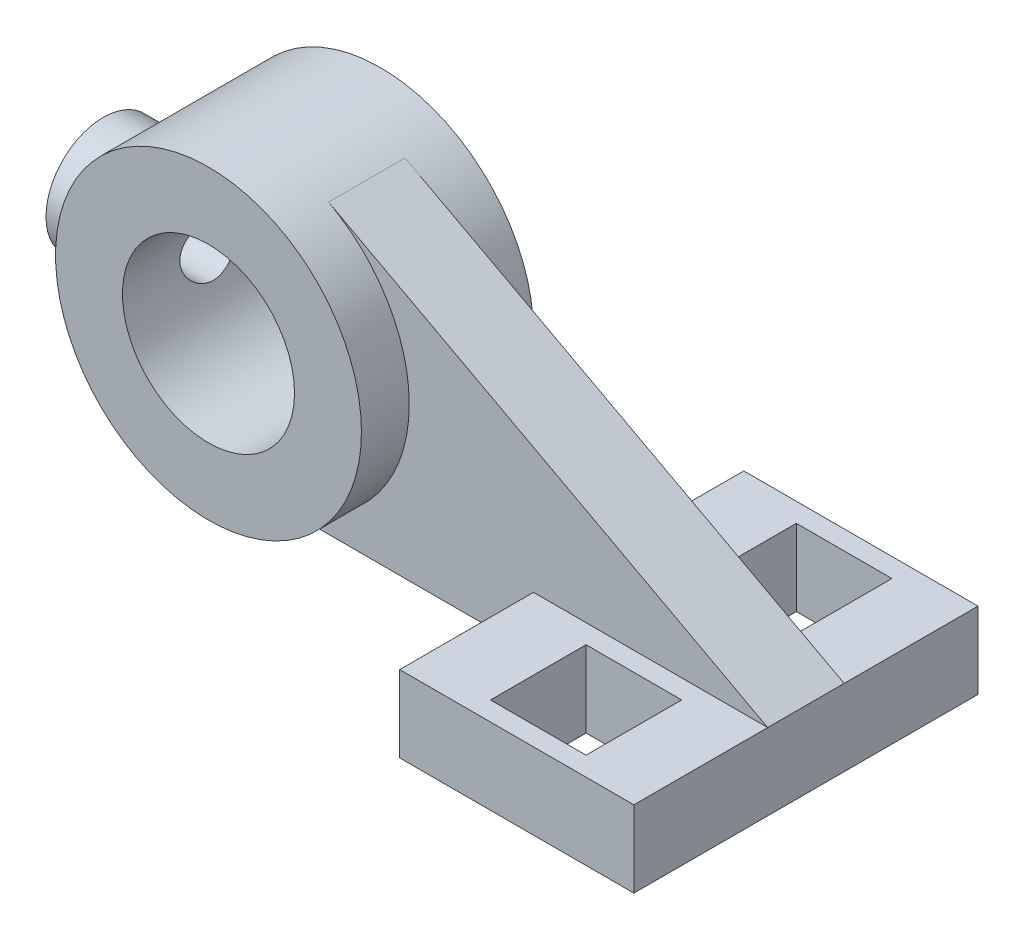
from build123d import *

# Parameters (mm, degrees)
EXTRUDE_1_DEPTH          = 36
EXTRUDE_1_DEPTH_BACK     = 36
SKETCH_1_R               = 64
SKETCH_1_R_2             = 36
EXTRUDE_2_DEPTH          = 16
EXTRUDE_2_DEPTH_BACK     = 16
EXTRUDE_3_DEPTH          = 72
EXTRUDE_3_DEPTH_BACK     = 72
SKETCH_1_4_W             = 98
SKETCH_1_4_H             = 32
SKETCH_2_W               = 40
SKETCH_2_H               = 40
CUT_EXTRUDE_1_DEPTH      = 250.491469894
EXTRUDE_4_REACH          = 313.636
EXTRUDE_4_END_RADIUS     = 64
SKETCH_3_R               = 24
CUT_EXTRUDE_2_REACH      = 313.636
CUT_EXTRUDE_2_END_RADIUS = 36
SKETCH_4_R               = 12


with BuildPart() as part:
    # Sketch 1 → Extrude 1 (new, two sides: drawn at the far end of the back side and taken through both)
    with BuildSketch(Plane.XY.offset(-EXTRUDE_1_DEPTH_BACK)):
        Circle(SKETCH_1_R)
        Circle(SKETCH_1_R_2, mode=Mode.SUBTRACT)
    extrude(amount=EXTRUDE_1_DEPTH + EXTRUDE_1_DEPTH_BACK)

    # Sketch 1_3 → Extrude 2 (add, two sides: drawn at the far end of the back side and taken through both)
    with BuildSketch(Plane.XY.offset(-EXTRUDE_2_DEPTH_BACK)):
        with BuildLine():
            Line((214, -42.141384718), (30.24689643, 56.40146502))
            ThreePointArc((30.24689643, 56.40146502), (54.917216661, 32.864864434), (64, 0))
            ThreePointArc((64, 0), (45.254833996, -45.254833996), (0, -64))
            Line((0, -64), (116, -64))
            Line((116, -64), (116, -42.141384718))
            Line((116, -42.141384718), (214, -42.141384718))
        make_face()
    extrude(amount=EXTRUDE_2_DEPTH + EXTRUDE_2_DEPTH_BACK)

    # Sketch 1_4 → Extrude 3 (add, two sides: drawn at the far end of the back side and taken through both)
    with BuildSketch(Plane.XY.offset(-EXTRUDE_3_DEPTH_BACK)):
        with Locations((165, -58.141384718)):
            Rectangle(SKETCH_1_4_W, SKETCH_1_4_H)
    extrude(amount=EXTRUDE_3_DEPTH + EXTRUDE_3_DEPTH_BACK)

    # Sketch 2 → Cut-Extrude 1 (cut, through all)
    with BuildSketch(Plane(origin=(0, -42.141384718, 0), x_dir=(1, 0, 0), z_dir=(0, 1, 0))):
        with Locations((166, -44)):
            Rectangle(SKETCH_2_W, SKETCH_2_H)
    cut_extrude_1 = extrude(amount=-CUT_EXTRUDE_1_DEPTH, mode=Mode.SUBTRACT)

    # Mirror 1: Cut-Extrude 1 across plane
    add(cut_extrude_1.mirror(Plane.XY), mode=Mode.SUBTRACT)

    # Extrude 4: up to this cylinder (the profile starts outside it)
    extrude_4_end = Plane(origin=(0, 0, 0), z_dir=(0, 0, 1)) * Cylinder(EXTRUDE_4_END_RADIUS, 756.272, mode=Mode.PRIVATE)
    # Sketch 3 → Extrude 4 (add, up to the surface)
    with BuildSketch(Plane(origin=(-80, 0, 0), x_dir=(0, 0, -1), z_dir=(1, 0, 0)), mode=Mode.PRIVATE) as extrude_4_sk1:
        with Locations(Location((0, 0, 0), (0, 0, 180))):
            Circle(SKETCH_3_R)
    extrude_4_tool1 = extrude(extrude_4_sk1.sketch, amount=EXTRUDE_4_REACH, mode=Mode.PRIVATE) - extrude_4_end
    add(extrude_4_tool1.solids().sort_by_distance((-80, 0, 0))[0])

    # Cut-Extrude 2: up to this cylinder (the profile starts outside it)
    cut_extrude_2_end = Plane(origin=(0, 0, 0), z_dir=(0, 0, 1)) * Cylinder(CUT_EXTRUDE_2_END_RADIUS, 700.272, mode=Mode.PRIVATE)
    # Sketch 4 → Cut-Extrude 2 (cut, up to the surface)
    with BuildSketch(Plane.ZY.offset(80), mode=Mode.PRIVATE) as cut_extrude_2_sk1:
        Circle(SKETCH_4_R)
    cut_extrude_2_tool1 = extrude(cut_extrude_2_sk1.sketch, amount=-CUT_EXTRUDE_2_REACH, mode=Mode.PRIVATE) - cut_extrude_2_end
    add(cut_extrude_2_tool1.solids().sort_by_distance((-80, 0, 0))[0], mode=Mode.SUBTRACT)


solid = part.part
